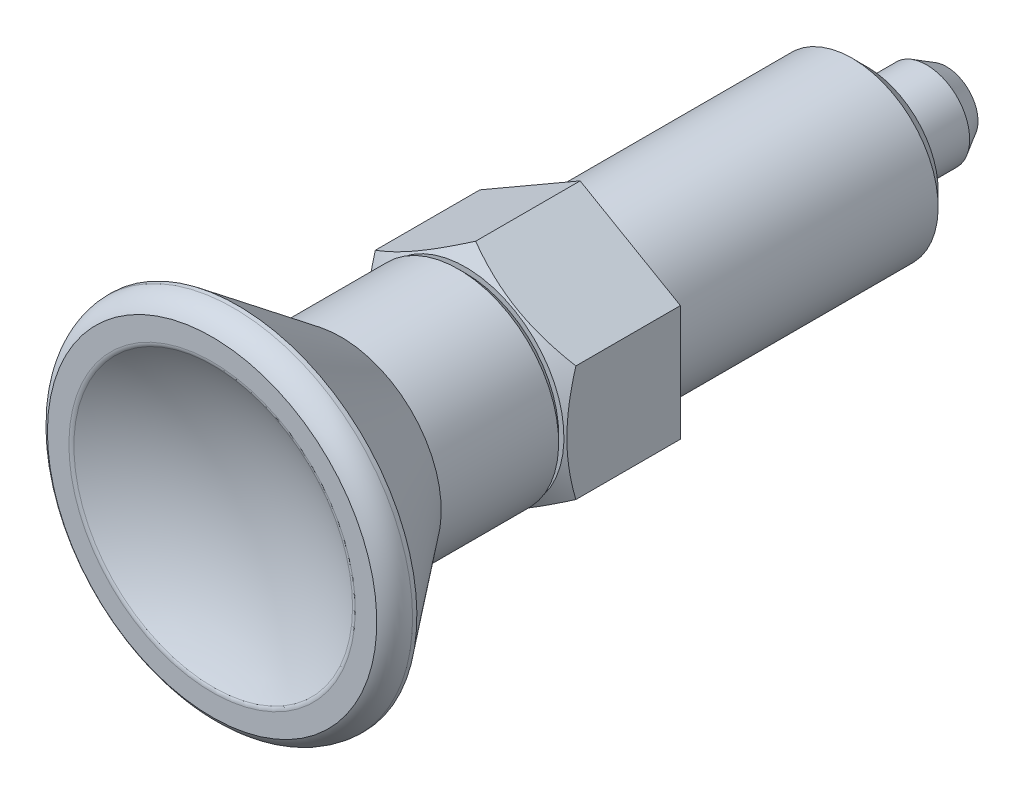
ISO-10303-21;
HEADER;
FILE_DESCRIPTION(('STEP AP214'),'2;1');
FILE_NAME('part.step','',(''),(''),'','','');
FILE_SCHEMA(('AUTOMOTIVE_DESIGN { 1 0 10303 214 1 1 1 1 }'));
ENDSEC;
DATA;
#1=APPLICATION_CONTEXT('core data for automotive mechanical design processes');
#2=APPLICATION_PROTOCOL_DEFINITION('international standard','automotive_design',2000,#1);
#3=PRODUCT_CONTEXT('',#1,'mechanical');
#4=PRODUCT('Part','Part','',(#3));
#5=PRODUCT_RELATED_PRODUCT_CATEGORY('part','',(#4));
#6=PRODUCT_DEFINITION_FORMATION('','',#4);
#7=PRODUCT_DEFINITION_CONTEXT('part definition',#1,'design');
#8=PRODUCT_DEFINITION('design','',#6,#7);
#9=PRODUCT_DEFINITION_SHAPE('','',#8);
#10=(LENGTH_UNIT() NAMED_UNIT(*) SI_UNIT(.MILLI.,.METRE.));
#11=(NAMED_UNIT(*) PLANE_ANGLE_UNIT() SI_UNIT($,.RADIAN.));
#12=(NAMED_UNIT(*) SI_UNIT($,.STERADIAN.) SOLID_ANGLE_UNIT());
#13=UNCERTAINTY_MEASURE_WITH_UNIT(LENGTH_MEASURE(1.E-05),#10,'distance_accuracy_value','');
#14=(GEOMETRIC_REPRESENTATION_CONTEXT(3) GLOBAL_UNCERTAINTY_ASSIGNED_CONTEXT((#13)) GLOBAL_UNIT_ASSIGNED_CONTEXT((#10,
#11,#12)) REPRESENTATION_CONTEXT('',''));
#15=CARTESIAN_POINT('',(0.,0.,0.));
#16=DIRECTION('',(0.,0.,1.));
#17=DIRECTION('',(1.,0.,0.));
#18=AXIS2_PLACEMENT_3D('',#15,#16,#17);
#19=CARTESIAN_POINT('',(0.,0.,-20.));
#20=DIRECTION('',(0.,0.,1.));
#21=DIRECTION('',(0.866025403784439,-0.5,0.));
#22=AXIS2_PLACEMENT_3D('',#19,#20,#21);
#23=CONICAL_SURFACE('',#22,5.,0.785398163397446);
#24=CARTESIAN_POINT('',(0.,0.,-19.));
#25=DIRECTION('',(0.,0.,1.));
#26=DIRECTION('',(0.866025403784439,-0.5,0.));
#27=AXIS2_PLACEMENT_3D('',#24,#25,#26);
#28=CIRCLE('',#27,6.);
#29=CARTESIAN_POINT('',(5.19615242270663,-3.,-19.));
#30=VERTEX_POINT('',#29);
#31=EDGE_CURVE('E341',#30,#30,#28,.T.);
#32=ORIENTED_EDGE('',*,*,#31,.F.);
#33=EDGE_LOOP('',(#32));
#34=FACE_BOUND('',#33,.T.);
#35=CARTESIAN_POINT('',(0.,0.,-20.));
#36=DIRECTION('',(0.,0.,-1.));
#37=DIRECTION('',(0.866025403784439,-0.5,0.));
#38=AXIS2_PLACEMENT_3D('',#35,#36,#37);
#39=CIRCLE('',#38,5.);
#40=CARTESIAN_POINT('',(4.3301270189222,-2.5,-20.));
#41=VERTEX_POINT('',#40);
#42=EDGE_CURVE('E297',#41,#41,#39,.T.);
#43=ORIENTED_EDGE('',*,*,#42,.F.);
#44=EDGE_LOOP('',(#43));
#45=FACE_BOUND('',#44,.T.);
#46=ADVANCED_FACE('F14',(#34,#45),#23,.T.);
#47=CARTESIAN_POINT('',(0.,0.,0.));
#48=DIRECTION('',(0.,0.,-1.));
#49=DIRECTION('',(0.866025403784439,-0.5,0.));
#50=AXIS2_PLACEMENT_3D('',#47,#48,#49);
#51=CYLINDRICAL_SURFACE('',#50,6.);
#52=CARTESIAN_POINT('',(0.,0.,0.));
#53=DIRECTION('',(0.,0.,1.));
#54=DIRECTION('',(0.866025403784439,-0.5,0.));
#55=AXIS2_PLACEMENT_3D('',#52,#53,#54);
#56=CIRCLE('',#55,6.);
#57=CARTESIAN_POINT('',(5.19615242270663,-3.,0.));
#58=VERTEX_POINT('',#57);
#59=EDGE_CURVE('E346',#58,#58,#56,.T.);
#60=ORIENTED_EDGE('',*,*,#59,.F.);
#61=EDGE_LOOP('',(#60));
#62=FACE_BOUND('',#61,.T.);
#63=ORIENTED_EDGE('',*,*,#31,.T.);
#64=EDGE_LOOP('',(#63));
#65=FACE_BOUND('',#64,.T.);
#66=ADVANCED_FACE('F170',(#62,#65),#51,.T.);
#67=CARTESIAN_POINT('',(-3.42233752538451,12.7723375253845,0.));
#68=DIRECTION('',(0.,0.,-1.));
#69=DIRECTION('',(0.866025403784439,-0.5,0.));
#70=AXIS2_PLACEMENT_3D('',#67,#68,#69);
#71=PLANE('',#70);
#72=DIRECTION('',(-0.866025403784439,0.5,0.));
#73=VECTOR('',#72,1.);
#74=CARTESIAN_POINT('',(0.,-8.08290376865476,0.));
#75=LINE('',#74,#73);
#76=CARTESIAN_POINT('',(0.,-8.08290376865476,0.));
#77=VERTEX_POINT('',#76);
#78=CARTESIAN_POINT('',(-7.,-4.04145188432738,0.));
#79=VERTEX_POINT('',#78);
#80=EDGE_CURVE('E345',#77,#79,#75,.T.);
#81=ORIENTED_EDGE('',*,*,#80,.T.);
#82=DIRECTION('',(0.,1.,0.));
#83=VECTOR('',#82,1.);
#84=CARTESIAN_POINT('',(-7.,-4.04145188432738,0.));
#85=LINE('',#84,#83);
#86=CARTESIAN_POINT('',(-7.,4.04145188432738,0.));
#87=VERTEX_POINT('',#86);
#88=EDGE_CURVE('E97',#79,#87,#85,.T.);
#89=ORIENTED_EDGE('',*,*,#88,.T.);
#90=DIRECTION('',(0.866025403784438,0.5,0.));
#91=VECTOR('',#90,1.);
#92=CARTESIAN_POINT('',(-7.,4.04145188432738,0.));
#93=LINE('',#92,#91);
#94=CARTESIAN_POINT('',(0.,8.08290376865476,0.));
#95=VERTEX_POINT('',#94);
#96=EDGE_CURVE('E81',#87,#95,#93,.T.);
#97=ORIENTED_EDGE('',*,*,#96,.T.);
#98=DIRECTION('',(0.866025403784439,-0.5,0.));
#99=VECTOR('',#98,1.);
#100=CARTESIAN_POINT('',(0.,8.08290376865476,0.));
#101=LINE('',#100,#99);
#102=CARTESIAN_POINT('',(7.,4.04145188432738,0.));
#103=VERTEX_POINT('',#102);
#104=EDGE_CURVE('E87',#95,#103,#101,.T.);
#105=ORIENTED_EDGE('',*,*,#104,.T.);
#106=DIRECTION('',(0.,-1.,0.));
#107=VECTOR('',#106,1.);
#108=CARTESIAN_POINT('',(7.,4.04145188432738,0.));
#109=LINE('',#108,#107);
#110=CARTESIAN_POINT('',(7.,-4.04145188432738,0.));
#111=VERTEX_POINT('',#110);
#112=EDGE_CURVE('E39',#103,#111,#109,.T.);
#113=ORIENTED_EDGE('',*,*,#112,.T.);
#114=DIRECTION('',(-0.866025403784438,-0.5,0.));
#115=VECTOR('',#114,1.);
#116=CARTESIAN_POINT('',(7.,-4.04145188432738,0.));
#117=LINE('',#116,#115);
#118=EDGE_CURVE('E281',#111,#77,#117,.T.);
#119=ORIENTED_EDGE('',*,*,#118,.T.);
#120=EDGE_LOOP('',(#81,#89,#97,#105,#113,#119));
#121=FACE_BOUND('',#120,.T.);
#122=ORIENTED_EDGE('',*,*,#59,.T.);
#123=EDGE_LOOP('',(#122));
#124=FACE_BOUND('',#123,.T.);
#125=ADVANCED_FACE('F95',(#121,#124),#71,.T.);
#126=CARTESIAN_POINT('',(-7.,-4.04145188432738,8.));
#127=DIRECTION('',(0.5,0.866025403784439,0.));
#128=DIRECTION('',(0.866025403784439,-0.5,0.));
#129=AXIS2_PLACEMENT_3D('',#126,#127,#128);
#130=PLANE('',#129);
#131=DIRECTION('',(0.,0.,-1.));
#132=VECTOR('',#131,1.);
#133=CARTESIAN_POINT('',(-7.,-4.04145188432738,7.3));
#134=LINE('',#133,#132);
#135=CARTESIAN_POINT('',(-7.,-4.04145188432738,7.3));
#136=VERTEX_POINT('',#135);
#137=EDGE_CURVE('E350',#136,#79,#134,.T.);
#138=ORIENTED_EDGE('',*,*,#137,.T.);
#139=ORIENTED_EDGE('',*,*,#80,.F.);
#140=DIRECTION('',(0.,0.,1.));
#141=VECTOR('',#140,1.);
#142=CARTESIAN_POINT('',(0.,-8.08290376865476,0.));
#143=LINE('',#142,#141);
#144=CARTESIAN_POINT('',(0.,-8.08290376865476,7.3));
#145=VERTEX_POINT('',#144);
#146=EDGE_CURVE('E112',#77,#145,#143,.T.);
#147=ORIENTED_EDGE('',*,*,#146,.T.);
#148=CARTESIAN_POINT('',(-7.,-4.04145188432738,7.3));
#149=CARTESIAN_POINT('',(-3.5,-6.06217782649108,8.46666666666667));
#150=CARTESIAN_POINT('',(0.,-8.08290376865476,7.3));
#151=(BOUNDED_CURVE() B_SPLINE_CURVE(2,(#148,#149,#150),.UNSPECIFIED.,.F.,
.F.) B_SPLINE_CURVE_WITH_KNOTS((3,3),(0.,1.),
.UNSPECIFIED.) CURVE() GEOMETRIC_REPRESENTATION_ITEM() RATIONAL_B_SPLINE_CURVE((1.,
1.15470053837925,1.)) REPRESENTATION_ITEM(''));
#152=EDGE_CURVE('E318',#136,#145,#151,.T.);
#153=ORIENTED_EDGE('',*,*,#152,.F.);
#154=EDGE_LOOP('',(#138,#139,#147,#153));
#155=FACE_BOUND('',#154,.T.);
#156=ADVANCED_FACE('F187',(#155),#130,.F.);
#157=CARTESIAN_POINT('',(-7.,4.04145188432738,8.));
#158=DIRECTION('',(1.,0.,0.));
#159=DIRECTION('',(0.,-1.,0.));
#160=AXIS2_PLACEMENT_3D('',#157,#158,#159);
#161=PLANE('',#160);
#162=DIRECTION('',(0.,0.,-1.));
#163=VECTOR('',#162,1.);
#164=CARTESIAN_POINT('',(-7.,4.04145188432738,7.3));
#165=LINE('',#164,#163);
#166=CARTESIAN_POINT('',(-7.,4.04145188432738,7.3));
#167=VERTEX_POINT('',#166);
#168=EDGE_CURVE('E106',#167,#87,#165,.T.);
#169=ORIENTED_EDGE('',*,*,#168,.T.);
#170=ORIENTED_EDGE('',*,*,#88,.F.);
#171=ORIENTED_EDGE('',*,*,#137,.F.);
#172=CARTESIAN_POINT('',(-7.,4.04145188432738,7.3));
#173=CARTESIAN_POINT('',(-7.00000000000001,0.,8.46666666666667));
#174=CARTESIAN_POINT('',(-7.,-4.04145188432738,7.3));
#175=(BOUNDED_CURVE() B_SPLINE_CURVE(2,(#172,#173,#174),.UNSPECIFIED.,.F.,
.F.) B_SPLINE_CURVE_WITH_KNOTS((3,3),(0.,1.),
.UNSPECIFIED.) CURVE() GEOMETRIC_REPRESENTATION_ITEM() RATIONAL_B_SPLINE_CURVE((1.,
1.15470053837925,1.)) REPRESENTATION_ITEM(''));
#176=EDGE_CURVE('E309',#167,#136,#175,.T.);
#177=ORIENTED_EDGE('',*,*,#176,.F.);
#178=EDGE_LOOP('',(#169,#170,#171,#177));
#179=FACE_BOUND('',#178,.T.);
#180=ADVANCED_FACE('F191',(#179),#161,.F.);
#181=CARTESIAN_POINT('',(0.,8.08290376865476,8.));
#182=DIRECTION('',(0.5,-0.866025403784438,0.));
#183=DIRECTION('',(-0.866025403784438,-0.5,0.));
#184=AXIS2_PLACEMENT_3D('',#181,#182,#183);
#185=PLANE('',#184);
#186=DIRECTION('',(0.,0.,-1.));
#187=VECTOR('',#186,1.);
#188=CARTESIAN_POINT('',(0.,8.08290376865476,7.3));
#189=LINE('',#188,#187);
#190=CARTESIAN_POINT('',(0.,8.08290376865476,7.3));
#191=VERTEX_POINT('',#190);
#192=EDGE_CURVE('E90',#191,#95,#189,.T.);
#193=ORIENTED_EDGE('',*,*,#192,.T.);
#194=ORIENTED_EDGE('',*,*,#96,.F.);
#195=ORIENTED_EDGE('',*,*,#168,.F.);
#196=CARTESIAN_POINT('',(0.,8.08290376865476,7.3));
#197=CARTESIAN_POINT('',(-3.5,6.06217782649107,8.46666666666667));
#198=CARTESIAN_POINT('',(-7.,4.04145188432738,7.3));
#199=(BOUNDED_CURVE() B_SPLINE_CURVE(2,(#196,#197,#198),.UNSPECIFIED.,.F.,
.F.) B_SPLINE_CURVE_WITH_KNOTS((3,3),(0.,1.),
.UNSPECIFIED.) CURVE() GEOMETRIC_REPRESENTATION_ITEM() RATIONAL_B_SPLINE_CURVE((1.,
1.15470053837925,1.)) REPRESENTATION_ITEM(''));
#200=EDGE_CURVE('E103',#191,#167,#199,.T.);
#201=ORIENTED_EDGE('',*,*,#200,.F.);
#202=EDGE_LOOP('',(#193,#194,#195,#201));
#203=FACE_BOUND('',#202,.T.);
#204=ADVANCED_FACE('F101',(#203),#185,.F.);
#205=CARTESIAN_POINT('',(7.,4.04145188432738,8.));
#206=DIRECTION('',(-0.5,-0.866025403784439,0.));
#207=DIRECTION('',(-0.866025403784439,0.5,0.));
#208=AXIS2_PLACEMENT_3D('',#205,#206,#207);
#209=PLANE('',#208);
#210=DIRECTION('',(0.,0.,-1.));
#211=VECTOR('',#210,1.);
#212=CARTESIAN_POINT('',(7.,4.04145188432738,7.3));
#213=LINE('',#212,#211);
#214=CARTESIAN_POINT('',(7.,4.04145188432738,7.3));
#215=VERTEX_POINT('',#214);
#216=EDGE_CURVE('E91',#215,#103,#213,.T.);
#217=ORIENTED_EDGE('',*,*,#216,.T.);
#218=ORIENTED_EDGE('',*,*,#104,.F.);
#219=ORIENTED_EDGE('',*,*,#192,.F.);
#220=CARTESIAN_POINT('',(7.,4.04145188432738,7.3));
#221=CARTESIAN_POINT('',(3.5,6.06217782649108,8.46666666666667));
#222=CARTESIAN_POINT('',(0.,8.08290376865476,7.3));
#223=(BOUNDED_CURVE() B_SPLINE_CURVE(2,(#220,#221,#222),.UNSPECIFIED.,.F.,
.F.) B_SPLINE_CURVE_WITH_KNOTS((3,3),(0.,1.),
.UNSPECIFIED.) CURVE() GEOMETRIC_REPRESENTATION_ITEM() RATIONAL_B_SPLINE_CURVE((1.,
1.15470053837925,1.)) REPRESENTATION_ITEM(''));
#224=EDGE_CURVE('E288',#215,#191,#223,.T.);
#225=ORIENTED_EDGE('',*,*,#224,.F.);
#226=EDGE_LOOP('',(#217,#218,#219,#225));
#227=FACE_BOUND('',#226,.T.);
#228=ADVANCED_FACE('F88',(#227),#209,.F.);
#229=CARTESIAN_POINT('',(7.,-4.04145188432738,8.));
#230=DIRECTION('',(-1.,0.,0.));
#231=DIRECTION('',(0.,1.,0.));
#232=AXIS2_PLACEMENT_3D('',#229,#230,#231);
#233=PLANE('',#232);
#234=DIRECTION('',(0.,0.,-1.));
#235=VECTOR('',#234,1.);
#236=CARTESIAN_POINT('',(7.,-4.04145188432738,7.3));
#237=LINE('',#236,#235);
#238=CARTESIAN_POINT('',(7.,-4.04145188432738,7.3));
#239=VERTEX_POINT('',#238);
#240=EDGE_CURVE('E120',#239,#111,#237,.T.);
#241=ORIENTED_EDGE('',*,*,#240,.T.);
#242=ORIENTED_EDGE('',*,*,#112,.F.);
#243=ORIENTED_EDGE('',*,*,#216,.F.);
#244=CARTESIAN_POINT('',(7.,-4.04145188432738,7.3));
#245=CARTESIAN_POINT('',(7.,0.,8.46666666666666));
#246=CARTESIAN_POINT('',(7.,4.04145188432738,7.3));
#247=(BOUNDED_CURVE() B_SPLINE_CURVE(2,(#244,#245,#246),.UNSPECIFIED.,.F.,
.F.) B_SPLINE_CURVE_WITH_KNOTS((3,3),(0.,1.),
.UNSPECIFIED.) CURVE() GEOMETRIC_REPRESENTATION_ITEM() RATIONAL_B_SPLINE_CURVE((1.,
1.15470053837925,1.)) REPRESENTATION_ITEM(''));
#248=EDGE_CURVE('E279',#239,#215,#247,.T.);
#249=ORIENTED_EDGE('',*,*,#248,.F.);
#250=EDGE_LOOP('',(#241,#242,#243,#249));
#251=FACE_BOUND('',#250,.T.);
#252=ADVANCED_FACE('F200',(#251),#233,.F.);
#253=CARTESIAN_POINT('',(0.,-8.08290376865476,8.));
#254=DIRECTION('',(-0.5,0.866025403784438,0.));
#255=DIRECTION('',(0.866025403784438,0.5,0.));
#256=AXIS2_PLACEMENT_3D('',#253,#254,#255);
#257=PLANE('',#256);
#258=ORIENTED_EDGE('',*,*,#146,.F.);
#259=ORIENTED_EDGE('',*,*,#118,.F.);
#260=ORIENTED_EDGE('',*,*,#240,.F.);
#261=CARTESIAN_POINT('',(0.,-8.08290376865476,7.3));
#262=CARTESIAN_POINT('',(3.5,-6.06217782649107,8.46666666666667));
#263=CARTESIAN_POINT('',(7.,-4.04145188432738,7.3));
#264=(BOUNDED_CURVE() B_SPLINE_CURVE(2,(#261,#262,#263),.UNSPECIFIED.,.F.,
.F.) B_SPLINE_CURVE_WITH_KNOTS((3,3),(0.,1.),
.UNSPECIFIED.) CURVE() GEOMETRIC_REPRESENTATION_ITEM() RATIONAL_B_SPLINE_CURVE((1.,
1.15470053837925,1.)) REPRESENTATION_ITEM(''));
#265=EDGE_CURVE('E296',#145,#239,#264,.T.);
#266=ORIENTED_EDGE('',*,*,#265,.F.);
#267=EDGE_LOOP('',(#258,#259,#260,#266));
#268=FACE_BOUND('',#267,.T.);
#269=ADVANCED_FACE('F188',(#268),#257,.F.);
#270=CARTESIAN_POINT('',(0.,0.,8.5));
#271=DIRECTION('',(0.,0.,-1.));
#272=DIRECTION('',(0.866025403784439,-0.5,0.));
#273=AXIS2_PLACEMENT_3D('',#270,#271,#272);
#274=CONICAL_SURFACE('',#273,6.00444279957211,1.0471975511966);
#275=CARTESIAN_POINT('',(0.,0.,8.));
#276=DIRECTION('',(0.,0.,1.));
#277=DIRECTION('',(0.866025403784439,-0.5,0.));
#278=AXIS2_PLACEMENT_3D('',#275,#276,#277);
#279=CIRCLE('',#278,6.87046820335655);
#280=CARTESIAN_POINT('',(5.95,-3.43523410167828,8.));
#281=VERTEX_POINT('',#280);
#282=EDGE_CURVE('E289',#281,#281,#279,.T.);
#283=ORIENTED_EDGE('',*,*,#282,.F.);
#284=EDGE_LOOP('',(#283));
#285=FACE_BOUND('',#284,.T.);
#286=ORIENTED_EDGE('',*,*,#248,.T.);
#287=ORIENTED_EDGE('',*,*,#224,.T.);
#288=ORIENTED_EDGE('',*,*,#200,.T.);
#289=ORIENTED_EDGE('',*,*,#176,.T.);
#290=ORIENTED_EDGE('',*,*,#152,.T.);
#291=ORIENTED_EDGE('',*,*,#265,.T.);
#292=EDGE_LOOP('',(#286,#287,#288,#289,#290,#291));
#293=FACE_BOUND('',#292,.T.);
#294=ADVANCED_FACE('F203',(#285,#293),#274,.T.);
#295=CARTESIAN_POINT('',(-12.7723375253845,-3.42233752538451,8.));
#296=DIRECTION('',(0.,0.,1.));
#297=DIRECTION('',(0.866025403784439,-0.5,0.));
#298=AXIS2_PLACEMENT_3D('',#295,#296,#297);
#299=PLANE('',#298);
#300=CARTESIAN_POINT('',(0.,0.,8.));
#301=DIRECTION('',(0.,0.,1.));
#302=DIRECTION('',(-0.5,-0.866025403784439,0.));
#303=AXIS2_PLACEMENT_3D('',#300,#301,#302);
#304=CIRCLE('',#303,6.5);
#305=CARTESIAN_POINT('',(-3.25,-5.62916512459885,8.));
#306=VERTEX_POINT('',#305);
#307=EDGE_CURVE('E118',#306,#306,#304,.T.);
#308=ORIENTED_EDGE('',*,*,#307,.F.);
#309=EDGE_LOOP('',(#308));
#310=FACE_BOUND('',#309,.T.);
#311=ORIENTED_EDGE('',*,*,#282,.T.);
#312=EDGE_LOOP('',(#311));
#313=FACE_BOUND('',#312,.T.);
#314=ADVANCED_FACE('F182',(#310,#313),#299,.T.);
#315=CARTESIAN_POINT('',(0.,0.,8.));
#316=DIRECTION('',(0.,0.,1.));
#317=DIRECTION('',(0.866025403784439,-0.5,0.));
#318=AXIS2_PLACEMENT_3D('',#315,#316,#317);
#319=CONICAL_SURFACE('',#318,6.5,0.785398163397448);
#320=CARTESIAN_POINT('',(0.,0.,8.5));
#321=DIRECTION('',(0.,0.,1.));
#322=DIRECTION('',(0.866025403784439,-0.5,0.));
#323=AXIS2_PLACEMENT_3D('',#320,#321,#322);
#324=CIRCLE('',#323,7.);
#325=CARTESIAN_POINT('',(6.06217782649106,-3.5,8.5));
#326=VERTEX_POINT('',#325);
#327=EDGE_CURVE('E114',#326,#326,#324,.T.);
#328=ORIENTED_EDGE('',*,*,#327,.F.);
#329=EDGE_LOOP('',(#328));
#330=FACE_BOUND('',#329,.T.);
#331=ORIENTED_EDGE('',*,*,#307,.T.);
#332=EDGE_LOOP('',(#331));
#333=FACE_BOUND('',#332,.T.);
#334=ADVANCED_FACE('F393',(#330,#333),#319,.T.);
#335=CARTESIAN_POINT('',(0.,0.,16.7));
#336=DIRECTION('',(0.,0.,-1.));
#337=DIRECTION('',(0.866025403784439,-0.5,0.));
#338=AXIS2_PLACEMENT_3D('',#335,#336,#337);
#339=CYLINDRICAL_SURFACE('',#338,7.);
#340=ORIENTED_EDGE('',*,*,#327,.T.);
#341=EDGE_LOOP('',(#340));
#342=FACE_BOUND('',#341,.T.);
#343=CARTESIAN_POINT('',(0.,0.,16.7));
#344=DIRECTION('',(0.,0.,-1.));
#345=DIRECTION('',(0.866025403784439,-0.5,0.));
#346=AXIS2_PLACEMENT_3D('',#343,#344,#345);
#347=CIRCLE('',#346,7.);
#348=CARTESIAN_POINT('',(6.06217782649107,-3.5,16.7));
#349=VERTEX_POINT('',#348);
#350=EDGE_CURVE('E265',#349,#349,#347,.T.);
#351=ORIENTED_EDGE('',*,*,#350,.T.);
#352=EDGE_LOOP('',(#351));
#353=FACE_BOUND('',#352,.T.);
#354=ADVANCED_FACE('F401',(#342,#353),#339,.T.);
#355=CARTESIAN_POINT('',(0.,0.,16.7));
#356=DIRECTION('',(0.,0.,1.));
#357=DIRECTION('',(0.866025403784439,-0.5,0.));
#358=AXIS2_PLACEMENT_3D('',#355,#356,#357);
#359=CONICAL_SURFACE('',#358,7.,0.652330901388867);
#360=CARTESIAN_POINT('',(0.,0.,23.9000000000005));
#361=DIRECTION('',(0.,0.,-1.));
#362=DIRECTION('',(0.866025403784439,-0.5,0.));
#363=AXIS2_PLACEMENT_3D('',#360,#361,#362);
#364=CIRCLE('',#363,12.5);
#365=CARTESIAN_POINT('',(10.8253175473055,-6.25,23.9000000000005));
#366=VERTEX_POINT('',#365);
#367=EDGE_CURVE('E258',#366,#366,#364,.T.);
#368=ORIENTED_EDGE('',*,*,#367,.T.);
#369=EDGE_LOOP('',(#368));
#370=FACE_BOUND('',#369,.T.);
#371=ORIENTED_EDGE('',*,*,#350,.F.);
#372=EDGE_LOOP('',(#371));
#373=FACE_BOUND('',#372,.T.);
#374=ADVANCED_FACE('F247',(#370,#373),#359,.T.);
#375=CARTESIAN_POINT('',(0.,0.,24.200000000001));
#376=DIRECTION('',(0.,0.,-1.));
#377=DIRECTION('',(0.866025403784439,-0.5,0.));
#378=AXIS2_PLACEMENT_3D('',#375,#376,#377);
#379=CYLINDRICAL_SURFACE('',#378,12.5);
#380=CARTESIAN_POINT('',(0.,0.,24.200000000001));
#381=DIRECTION('',(0.,0.,-1.));
#382=DIRECTION('',(0.866025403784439,-0.5,0.));
#383=AXIS2_PLACEMENT_3D('',#380,#381,#382);
#384=CIRCLE('',#383,12.5);
#385=CARTESIAN_POINT('',(10.8253175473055,-6.25,24.200000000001));
#386=VERTEX_POINT('',#385);
#387=EDGE_CURVE('E256',#386,#386,#384,.T.);
#388=ORIENTED_EDGE('',*,*,#387,.T.);
#389=EDGE_LOOP('',(#388));
#390=FACE_BOUND('',#389,.T.);
#391=ORIENTED_EDGE('',*,*,#367,.F.);
#392=EDGE_LOOP('',(#391));
#393=FACE_BOUND('',#392,.T.);
#394=ADVANCED_FACE('F238',(#390,#393),#379,.T.);
#395=CARTESIAN_POINT('',(0.,0.,23.9596620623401));
#396=DIRECTION('',(0.,0.,-1.));
#397=DIRECTION('',(0.,1.,0.));
#398=AXIS2_PLACEMENT_3D('',#395,#396,#397);
#399=TOROIDAL_SURFACE('',#398,10.5144930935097,1.99999999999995);
#400=CARTESIAN_POINT('',(0.,0.,25.7000000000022));
#401=DIRECTION('',(0.,0.,-1.));
#402=DIRECTION('',(0.866025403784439,-0.5,0.));
#403=AXIS2_PLACEMENT_3D('',#400,#401,#402);
#404=CIRCLE('',#403,11.4999999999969);
#405=CARTESIAN_POINT('',(9.95929214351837,-5.74999999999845,25.7000000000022));
#406=VERTEX_POINT('',#405);
#407=EDGE_CURVE('E253',#406,#406,#404,.T.);
#408=ORIENTED_EDGE('',*,*,#407,.T.);
#409=EDGE_LOOP('',(#408));
#410=FACE_BOUND('',#409,.T.);
#411=ORIENTED_EDGE('',*,*,#387,.F.);
#412=EDGE_LOOP('',(#411));
#413=FACE_BOUND('',#412,.T.);
#414=ADVANCED_FACE('F236',(#410,#413),#399,.T.);
#415=CARTESIAN_POINT('',(-17.2802213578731,-4.63022135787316,25.7000000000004));
#416=DIRECTION('',(0.,0.,1.));
#417=DIRECTION('',(0.866025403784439,-0.5,0.));
#418=AXIS2_PLACEMENT_3D('',#415,#416,#417);
#419=PLANE('',#418);
#420=ORIENTED_EDGE('',*,*,#407,.F.);
#421=EDGE_LOOP('',(#420));
#422=FACE_BOUND('',#421,.T.);
#423=CARTESIAN_POINT('',(0.,0.,25.7000000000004));
#424=DIRECTION('',(0.,0.,-1.));
#425=DIRECTION('',(0.866025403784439,-0.5,0.));
#426=AXIS2_PLACEMENT_3D('',#423,#424,#425);
#427=CIRCLE('',#426,10.);
#428=CARTESIAN_POINT('',(8.66025403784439,-5.,25.7000000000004));
#429=VERTEX_POINT('',#428);
#430=EDGE_CURVE('E267',#429,#429,#427,.T.);
#431=ORIENTED_EDGE('',*,*,#430,.T.);
#432=EDGE_LOOP('',(#431));
#433=FACE_BOUND('',#432,.T.);
#434=ADVANCED_FACE('F234',(#422,#433),#419,.T.);
#435=CARTESIAN_POINT('',(0.,0.,25.2000000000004));
#436=DIRECTION('',(0.,0.,-1.));
#437=DIRECTION('',(0.,1.,0.));
#438=AXIS2_PLACEMENT_3D('',#435,#436,#437);
#439=TOROIDAL_SURFACE('',#438,10.0000000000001,0.499999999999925);
#440=CARTESIAN_POINT('',(0.,0.,25.6206589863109));
#441=DIRECTION('',(0.,0.,-1.));
#442=DIRECTION('',(0.866025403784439,-0.5,0.));
#443=AXIS2_PLACEMENT_3D('',#440,#441,#442);
#444=CIRCLE('',#443,9.72972973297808);
#445=CARTESIAN_POINT('',(8.4261931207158,-4.86486486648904,25.6206589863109));
#446=VERTEX_POINT('',#445);
#447=EDGE_CURVE('E274',#446,#446,#444,.T.);
#448=ORIENTED_EDGE('',*,*,#447,.T.);
#449=EDGE_LOOP('',(#448));
#450=FACE_BOUND('',#449,.T.);
#451=ORIENTED_EDGE('',*,*,#430,.F.);
#452=EDGE_LOOP('',(#451));
#453=FACE_BOUND('',#452,.T.);
#454=ADVANCED_FACE('F232',(#450,#453),#439,.T.);
#455=CARTESIAN_POINT('',(-3.58626747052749E-13,2.06303351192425E-13,40.7643824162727));
#456=DIRECTION('',(0.,0.,-1.));
#457=DIRECTION('',(0.866025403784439,-0.5,0.));
#458=AXIS2_PLACEMENT_3D('',#455,#456,#457);
#459=SPHERICAL_SURFACE('',#458,17.9999999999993);
#460=ORIENTED_EDGE('',*,*,#447,.F.);
#461=EDGE_LOOP('',(#460));
#462=FACE_BOUND('',#461,.T.);
#463=ADVANCED_FACE('F167',(#462),#459,.F.);
#464=CARTESIAN_POINT('',(0.,0.,-20.0000000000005));
#465=DIRECTION('',(0.,0.,-1.));
#466=DIRECTION('',(0.866025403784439,-0.5,0.));
#467=AXIS2_PLACEMENT_3D('',#464,#465,#466);
#468=SPHERICAL_SURFACE('',#467,5.9999999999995);
#469=CARTESIAN_POINT('',(0.,0.,-25.5810746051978));
#470=DIRECTION('',(0.,0.,-1.));
#471=DIRECTION('',(0.866025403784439,-0.5,0.));
#472=AXIS2_PLACEMENT_3D('',#469,#470,#471);
#473=CIRCLE('',#472,2.20263620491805);
#474=CARTESIAN_POINT('',(1.90753890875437,-1.10131810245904,-25.5810746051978));
#475=VERTEX_POINT('',#474);
#476=EDGE_CURVE('E18',#475,#475,#473,.T.);
#477=ORIENTED_EDGE('',*,*,#476,.T.);
#478=EDGE_LOOP('',(#477));
#479=FACE_BOUND('',#478,.T.);
#480=ADVANCED_FACE('F152',(#479),#468,.T.);
#481=CARTESIAN_POINT('',(0.,0.,-25.5810746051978));
#482=DIRECTION('',(0.,0.,1.));
#483=DIRECTION('',(0.866025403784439,-0.5,0.));
#484=AXIS2_PLACEMENT_3D('',#481,#482,#483);
#485=CONICAL_SURFACE('',#484,2.20263620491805,0.523598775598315);
#486=CARTESIAN_POINT('',(0.,0.,-24.2));
#487=DIRECTION('',(0.,0.,-1.));
#488=DIRECTION('',(0.866025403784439,-0.5,0.));
#489=AXIS2_PLACEMENT_3D('',#486,#487,#488);
#490=CIRCLE('',#489,3.);
#491=CARTESIAN_POINT('',(2.59807621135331,-1.50000000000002,-24.2));
#492=VERTEX_POINT('',#491);
#493=EDGE_CURVE('E136',#492,#492,#490,.T.);
#494=ORIENTED_EDGE('',*,*,#493,.T.);
#495=EDGE_LOOP('',(#494));
#496=FACE_BOUND('',#495,.T.);
#497=ORIENTED_EDGE('',*,*,#476,.F.);
#498=EDGE_LOOP('',(#497));
#499=FACE_BOUND('',#498,.T.);
#500=ADVANCED_FACE('F154',(#496,#499),#485,.T.);
#501=CARTESIAN_POINT('',(0.,0.,-20.5));
#502=DIRECTION('',(0.,0.,-1.));
#503=DIRECTION('',(0.866025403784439,-0.5,0.));
#504=AXIS2_PLACEMENT_3D('',#501,#502,#503);
#505=CYLINDRICAL_SURFACE('',#504,3.);
#506=CARTESIAN_POINT('',(0.,0.,-20.5));
#507=DIRECTION('',(0.,0.,-1.));
#508=DIRECTION('',(0.866025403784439,-0.5,0.));
#509=AXIS2_PLACEMENT_3D('',#506,#507,#508);
#510=CIRCLE('',#509,3.);
#511=CARTESIAN_POINT('',(2.59807621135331,-1.50000000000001,-20.5));
#512=VERTEX_POINT('',#511);
#513=EDGE_CURVE('E133',#512,#512,#510,.T.);
#514=ORIENTED_EDGE('',*,*,#513,.T.);
#515=EDGE_LOOP('',(#514));
#516=FACE_BOUND('',#515,.T.);
#517=ORIENTED_EDGE('',*,*,#493,.F.);
#518=EDGE_LOOP('',(#517));
#519=FACE_BOUND('',#518,.T.);
#520=ADVANCED_FACE('F156',(#516,#519),#505,.T.);
#521=CARTESIAN_POINT('',(0.,0.,-20.3732050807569));
#522=DIRECTION('',(0.,0.,-1.));
#523=DIRECTION('',(0.866025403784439,-0.5,0.));
#524=AXIS2_PLACEMENT_3D('',#521,#522,#523);
#525=CONICAL_SURFACE('',#524,2.9267949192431,0.523598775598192);
#526=CARTESIAN_POINT('',(0.,0.,-20.3732050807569));
#527=DIRECTION('',(0.,0.,-1.));
#528=DIRECTION('',(0.866025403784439,-0.5,0.));
#529=AXIS2_PLACEMENT_3D('',#526,#527,#528);
#530=CIRCLE('',#529,2.9267949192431);
#531=CARTESIAN_POINT('',(2.53467875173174,-1.46339745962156,-20.3732050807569));
#532=VERTEX_POINT('',#531);
#533=EDGE_CURVE('E129',#532,#532,#530,.T.);
#534=ORIENTED_EDGE('',*,*,#533,.T.);
#535=EDGE_LOOP('',(#534));
#536=FACE_BOUND('',#535,.T.);
#537=ORIENTED_EDGE('',*,*,#513,.F.);
#538=EDGE_LOOP('',(#537));
#539=FACE_BOUND('',#538,.T.);
#540=ADVANCED_FACE('F164',(#536,#539),#525,.T.);
#541=CARTESIAN_POINT('',(0.,0.,-20.2732050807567));
#542=DIRECTION('',(0.,0.,-1.));
#543=DIRECTION('',(0.,1.,0.));
#544=AXIS2_PLACEMENT_3D('',#541,#542,#543);
#545=TOROIDAL_SURFACE('',#544,3.10000000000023,0.200000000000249);
#546=CARTESIAN_POINT('',(0.,0.,-20.2732050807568));
#547=DIRECTION('',(0.,0.,-1.));
#548=DIRECTION('',(0.866025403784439,-0.5,0.));
#549=AXIS2_PLACEMENT_3D('',#546,#547,#548);
#550=CIRCLE('',#549,2.9);
#551=CARTESIAN_POINT('',(2.51147367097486,-1.45000000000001,-20.2732050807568));
#552=VERTEX_POINT('',#551);
#553=EDGE_CURVE('E125',#552,#552,#550,.T.);
#554=ORIENTED_EDGE('',*,*,#553,.T.);
#555=EDGE_LOOP('',(#554));
#556=FACE_BOUND('',#555,.T.);
#557=ORIENTED_EDGE('',*,*,#533,.F.);
#558=EDGE_LOOP('',(#557));
#559=FACE_BOUND('',#558,.T.);
#560=ADVANCED_FACE('F212',(#556,#559),#545,.F.);
#561=CARTESIAN_POINT('',(0.,0.,-20.2));
#562=DIRECTION('',(0.,0.,-1.));
#563=DIRECTION('',(0.866025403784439,-0.5,0.));
#564=AXIS2_PLACEMENT_3D('',#561,#562,#563);
#565=CYLINDRICAL_SURFACE('',#564,2.9);
#566=CARTESIAN_POINT('',(0.,0.,-20.2));
#567=DIRECTION('',(0.,0.,-1.));
#568=DIRECTION('',(0.866025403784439,-0.5,0.));
#569=AXIS2_PLACEMENT_3D('',#566,#567,#568);
#570=CIRCLE('',#569,2.9);
#571=CARTESIAN_POINT('',(2.51147367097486,-1.45000000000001,-20.2));
#572=VERTEX_POINT('',#571);
#573=EDGE_CURVE('E25',#572,#572,#570,.T.);
#574=ORIENTED_EDGE('',*,*,#573,.T.);
#575=EDGE_LOOP('',(#574));
#576=FACE_BOUND('',#575,.T.);
#577=ORIENTED_EDGE('',*,*,#553,.F.);
#578=EDGE_LOOP('',(#577));
#579=FACE_BOUND('',#578,.T.);
#580=ADVANCED_FACE('F209',(#576,#579),#565,.T.);
#581=CARTESIAN_POINT('',(0.,0.,-20.2));
#582=DIRECTION('',(0.,0.,-1.));
#583=DIRECTION('',(-1.,0.,0.));
#584=AXIS2_PLACEMENT_3D('',#581,#582,#583);
#585=TOROIDAL_SURFACE('',#584,3.10000000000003,0.200000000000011);
#586=CARTESIAN_POINT('',(0.,0.,-20.));
#587=DIRECTION('',(0.,0.,-1.));
#588=DIRECTION('',(0.866025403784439,-0.5,0.));
#589=AXIS2_PLACEMENT_3D('',#586,#587,#588);
#590=CIRCLE('',#589,3.1);
#591=CARTESIAN_POINT('',(2.68467875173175,-1.55000000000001,-20.));
#592=VERTEX_POINT('',#591);
#593=EDGE_CURVE('E9',#592,#592,#590,.T.);
#594=ORIENTED_EDGE('',*,*,#593,.T.);
#595=EDGE_LOOP('',(#594));
#596=FACE_BOUND('',#595,.T.);
#597=ORIENTED_EDGE('',*,*,#573,.F.);
#598=EDGE_LOOP('',(#597));
#599=FACE_BOUND('',#598,.T.);
#600=ADVANCED_FACE('F16',(#596,#599),#585,.F.);
#601=CARTESIAN_POINT('',(-1.64143155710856,6.12590596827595,-20.));
#602=DIRECTION('',(0.,0.,-1.));
#603=DIRECTION('',(0.866025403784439,-0.5,0.));
#604=AXIS2_PLACEMENT_3D('',#601,#602,#603);
#605=PLANE('',#604);
#606=ORIENTED_EDGE('',*,*,#593,.F.);
#607=EDGE_LOOP('',(#606));
#608=FACE_BOUND('',#607,.T.);
#609=ORIENTED_EDGE('',*,*,#42,.T.);
#610=EDGE_LOOP('',(#609));
#611=FACE_BOUND('',#610,.T.);
#612=ADVANCED_FACE('F205',(#608,#611),#605,.T.);
#613=CLOSED_SHELL('',(#46,#66,#125,#156,#180,#204,#228,#252,#269,#294,#314,#334,#354,#374,#394,
#414,#434,#454,#463,#480,#500,#520,#540,#560,#580,#600,#612));
#614=MANIFOLD_SOLID_BREP('B1',#613);
#615=ADVANCED_BREP_SHAPE_REPRESENTATION('',(#18,#614),#14);
#616=SHAPE_DEFINITION_REPRESENTATION(#9,#615);
ENDSEC;
END-ISO-10303-21;
